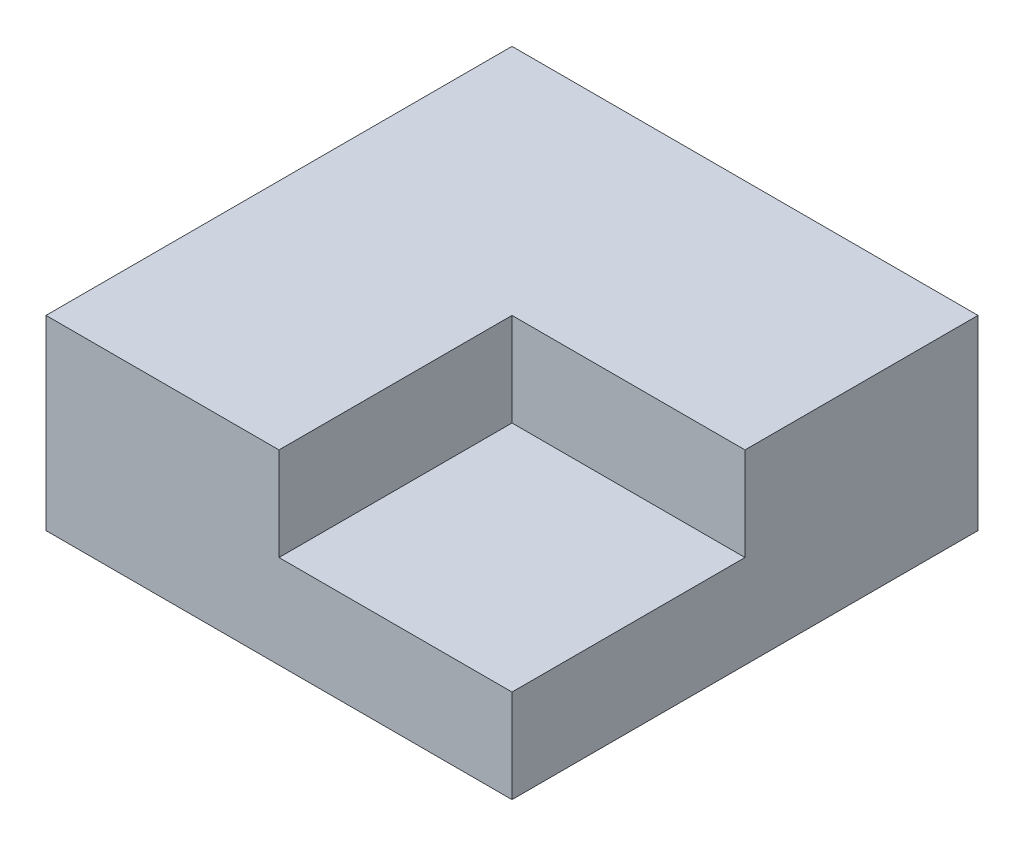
ISO-10303-21;
HEADER;
FILE_DESCRIPTION(('STEP AP214'),'2;1');
FILE_NAME('part.step','',(''),(''),'','','');
FILE_SCHEMA(('AUTOMOTIVE_DESIGN { 1 0 10303 214 1 1 1 1 }'));
ENDSEC;
DATA;
#1=APPLICATION_CONTEXT('core data for automotive mechanical design processes');
#2=APPLICATION_PROTOCOL_DEFINITION('international standard','automotive_design',2000,#1);
#3=PRODUCT_CONTEXT('',#1,'mechanical');
#4=PRODUCT('Part','Part','',(#3));
#5=PRODUCT_RELATED_PRODUCT_CATEGORY('part','',(#4));
#6=PRODUCT_DEFINITION_FORMATION('','',#4);
#7=PRODUCT_DEFINITION_CONTEXT('part definition',#1,'design');
#8=PRODUCT_DEFINITION('design','',#6,#7);
#9=PRODUCT_DEFINITION_SHAPE('','',#8);
#10=(LENGTH_UNIT() NAMED_UNIT(*) SI_UNIT(.MILLI.,.METRE.));
#11=(NAMED_UNIT(*) PLANE_ANGLE_UNIT() SI_UNIT($,.RADIAN.));
#12=(NAMED_UNIT(*) SI_UNIT($,.STERADIAN.) SOLID_ANGLE_UNIT());
#13=UNCERTAINTY_MEASURE_WITH_UNIT(LENGTH_MEASURE(1.E-05),#10,'distance_accuracy_value','');
#14=(GEOMETRIC_REPRESENTATION_CONTEXT(3) GLOBAL_UNCERTAINTY_ASSIGNED_CONTEXT((#13)) GLOBAL_UNIT_ASSIGNED_CONTEXT((#10,
#11,#12)) REPRESENTATION_CONTEXT('',''));
#15=CARTESIAN_POINT('',(0.,0.,0.));
#16=DIRECTION('',(0.,0.,1.));
#17=DIRECTION('',(1.,0.,0.));
#18=AXIS2_PLACEMENT_3D('',#15,#16,#17);
#19=CARTESIAN_POINT('',(0.,20.,0.));
#20=DIRECTION('',(1.,0.,0.));
#21=DIRECTION('',(0.,0.,-1.));
#22=AXIS2_PLACEMENT_3D('',#19,#20,#21);
#23=PLANE('',#22);
#24=DIRECTION('',(0.,0.,1.));
#25=VECTOR('',#24,1.);
#26=CARTESIAN_POINT('',(0.,0.,0.));
#27=LINE('',#26,#25);
#28=CARTESIAN_POINT('',(0.,0.,-50.));
#29=VERTEX_POINT('',#28);
#30=CARTESIAN_POINT('',(0.,0.,0.));
#31=VERTEX_POINT('',#30);
#32=EDGE_CURVE('E139',#29,#31,#27,.T.);
#33=ORIENTED_EDGE('',*,*,#32,.T.);
#34=DIRECTION('',(0.,-1.,0.));
#35=VECTOR('',#34,1.);
#36=CARTESIAN_POINT('',(0.,20.,0.));
#37=LINE('',#36,#35);
#38=CARTESIAN_POINT('',(0.,20.,0.));
#39=VERTEX_POINT('',#38);
#40=EDGE_CURVE('E11',#39,#31,#37,.T.);
#41=ORIENTED_EDGE('',*,*,#40,.F.);
#42=DIRECTION('',(0.,0.,1.));
#43=VECTOR('',#42,1.);
#44=CARTESIAN_POINT('',(0.,20.,0.));
#45=LINE('',#44,#43);
#46=CARTESIAN_POINT('',(0.,20.,-50.));
#47=VERTEX_POINT('',#46);
#48=EDGE_CURVE('E111',#47,#39,#45,.T.);
#49=ORIENTED_EDGE('',*,*,#48,.F.);
#50=DIRECTION('',(0.,-1.,0.));
#51=VECTOR('',#50,1.);
#52=CARTESIAN_POINT('',(0.,20.,-50.));
#53=LINE('',#52,#51);
#54=EDGE_CURVE('E121',#47,#29,#53,.T.);
#55=ORIENTED_EDGE('',*,*,#54,.T.);
#56=EDGE_LOOP('',(#33,#41,#49,#55));
#57=FACE_BOUND('',#56,.T.);
#58=ADVANCED_FACE('F31',(#57),#23,.F.);
#59=CARTESIAN_POINT('',(0.,20.,0.));
#60=DIRECTION('',(0.,0.,-1.));
#61=DIRECTION('',(-1.,0.,0.));
#62=AXIS2_PLACEMENT_3D('',#59,#60,#61);
#63=PLANE('',#62);
#64=DIRECTION('',(1.,0.,0.));
#65=VECTOR('',#64,1.);
#66=CARTESIAN_POINT('',(25.,10.,0.));
#67=LINE('',#66,#65);
#68=CARTESIAN_POINT('',(25.,10.,0.));
#69=VERTEX_POINT('',#68);
#70=CARTESIAN_POINT('',(50.,10.,0.));
#71=VERTEX_POINT('',#70);
#72=EDGE_CURVE('E106',#69,#71,#67,.T.);
#73=ORIENTED_EDGE('',*,*,#72,.F.);
#74=DIRECTION('',(0.,1.,0.));
#75=VECTOR('',#74,1.);
#76=CARTESIAN_POINT('',(25.,10.,0.));
#77=LINE('',#76,#75);
#78=CARTESIAN_POINT('',(25.,20.,0.));
#79=VERTEX_POINT('',#78);
#80=EDGE_CURVE('E95',#69,#79,#77,.T.);
#81=ORIENTED_EDGE('',*,*,#80,.T.);
#82=DIRECTION('',(1.,0.,0.));
#83=VECTOR('',#82,1.);
#84=CARTESIAN_POINT('',(0.,20.,0.));
#85=LINE('',#84,#83);
#86=EDGE_CURVE('E104',#39,#79,#85,.T.);
#87=ORIENTED_EDGE('',*,*,#86,.F.);
#88=ORIENTED_EDGE('',*,*,#40,.T.);
#89=DIRECTION('',(1.,0.,0.));
#90=VECTOR('',#89,1.);
#91=CARTESIAN_POINT('',(0.,0.,0.));
#92=LINE('',#91,#90);
#93=CARTESIAN_POINT('',(50.,0.,0.));
#94=VERTEX_POINT('',#93);
#95=EDGE_CURVE('E135',#31,#94,#92,.T.);
#96=ORIENTED_EDGE('',*,*,#95,.T.);
#97=DIRECTION('',(0.,-1.,0.));
#98=VECTOR('',#97,1.);
#99=CARTESIAN_POINT('',(50.,20.,0.));
#100=LINE('',#99,#98);
#101=EDGE_CURVE('E38',#71,#94,#100,.T.);
#102=ORIENTED_EDGE('',*,*,#101,.F.);
#103=EDGE_LOOP('',(#73,#81,#87,#88,#96,#102));
#104=FACE_BOUND('',#103,.T.);
#105=ADVANCED_FACE('F103',(#104),#63,.F.);
#106=CARTESIAN_POINT('',(50.,20.,0.));
#107=DIRECTION('',(-1.,0.,0.));
#108=DIRECTION('',(0.,0.,1.));
#109=AXIS2_PLACEMENT_3D('',#106,#107,#108);
#110=PLANE('',#109);
#111=DIRECTION('',(0.,0.,-1.));
#112=VECTOR('',#111,1.);
#113=CARTESIAN_POINT('',(50.,20.,0.));
#114=LINE('',#113,#112);
#115=CARTESIAN_POINT('',(50.,20.,-25.));
#116=VERTEX_POINT('',#115);
#117=CARTESIAN_POINT('',(50.,20.,-50.));
#118=VERTEX_POINT('',#117);
#119=EDGE_CURVE('E113',#116,#118,#114,.T.);
#120=ORIENTED_EDGE('',*,*,#119,.F.);
#121=DIRECTION('',(0.,1.,0.));
#122=VECTOR('',#121,1.);
#123=CARTESIAN_POINT('',(50.,10.,-25.));
#124=LINE('',#123,#122);
#125=CARTESIAN_POINT('',(50.,10.,-25.));
#126=VERTEX_POINT('',#125);
#127=EDGE_CURVE('E45',#126,#116,#124,.T.);
#128=ORIENTED_EDGE('',*,*,#127,.F.);
#129=DIRECTION('',(0.,0.,-1.));
#130=VECTOR('',#129,1.);
#131=CARTESIAN_POINT('',(50.,10.,0.));
#132=LINE('',#131,#130);
#133=EDGE_CURVE('E134',#71,#126,#132,.T.);
#134=ORIENTED_EDGE('',*,*,#133,.F.);
#135=ORIENTED_EDGE('',*,*,#101,.T.);
#136=DIRECTION('',(0.,0.,-1.));
#137=VECTOR('',#136,1.);
#138=CARTESIAN_POINT('',(50.,0.,0.));
#139=LINE('',#138,#137);
#140=CARTESIAN_POINT('',(50.,0.,-50.));
#141=VERTEX_POINT('',#140);
#142=EDGE_CURVE('E133',#94,#141,#139,.T.);
#143=ORIENTED_EDGE('',*,*,#142,.T.);
#144=DIRECTION('',(0.,-1.,0.));
#145=VECTOR('',#144,1.);
#146=CARTESIAN_POINT('',(50.,20.,-50.));
#147=LINE('',#146,#145);
#148=EDGE_CURVE('E124',#118,#141,#147,.T.);
#149=ORIENTED_EDGE('',*,*,#148,.F.);
#150=EDGE_LOOP('',(#120,#128,#134,#135,#143,#149));
#151=FACE_BOUND('',#150,.T.);
#152=ADVANCED_FACE('F130',(#151),#110,.F.);
#153=CARTESIAN_POINT('',(0.,20.,-50.));
#154=DIRECTION('',(0.,0.,1.));
#155=DIRECTION('',(1.,0.,0.));
#156=AXIS2_PLACEMENT_3D('',#153,#154,#155);
#157=PLANE('',#156);
#158=DIRECTION('',(-1.,0.,0.));
#159=VECTOR('',#158,1.);
#160=CARTESIAN_POINT('',(0.,0.,-50.));
#161=LINE('',#160,#159);
#162=EDGE_CURVE('E116',#141,#29,#161,.T.);
#163=ORIENTED_EDGE('',*,*,#162,.T.);
#164=ORIENTED_EDGE('',*,*,#54,.F.);
#165=DIRECTION('',(-1.,0.,0.));
#166=VECTOR('',#165,1.);
#167=CARTESIAN_POINT('',(0.,20.,-50.));
#168=LINE('',#167,#166);
#169=EDGE_CURVE('E53',#118,#47,#168,.T.);
#170=ORIENTED_EDGE('',*,*,#169,.F.);
#171=ORIENTED_EDGE('',*,*,#148,.T.);
#172=EDGE_LOOP('',(#163,#164,#170,#171));
#173=FACE_BOUND('',#172,.T.);
#174=ADVANCED_FACE('F156',(#173),#157,.F.);
#175=CARTESIAN_POINT('',(0.,20.,-50.));
#176=DIRECTION('',(0.,-1.,0.));
#177=DIRECTION('',(0.,0.,-1.));
#178=AXIS2_PLACEMENT_3D('',#175,#176,#177);
#179=PLANE('',#178);
#180=ORIENTED_EDGE('',*,*,#86,.T.);
#181=DIRECTION('',(0.,0.,1.));
#182=VECTOR('',#181,1.);
#183=CARTESIAN_POINT('',(25.,20.,0.));
#184=LINE('',#183,#182);
#185=CARTESIAN_POINT('',(25.,20.,-25.));
#186=VERTEX_POINT('',#185);
#187=EDGE_CURVE('E91',#186,#79,#184,.T.);
#188=ORIENTED_EDGE('',*,*,#187,.F.);
#189=DIRECTION('',(-1.,0.,0.));
#190=VECTOR('',#189,1.);
#191=CARTESIAN_POINT('',(25.,20.,-25.));
#192=LINE('',#191,#190);
#193=EDGE_CURVE('E99',#116,#186,#192,.T.);
#194=ORIENTED_EDGE('',*,*,#193,.F.);
#195=ORIENTED_EDGE('',*,*,#119,.T.);
#196=ORIENTED_EDGE('',*,*,#169,.T.);
#197=ORIENTED_EDGE('',*,*,#48,.T.);
#198=EDGE_LOOP('',(#180,#188,#194,#195,#196,#197));
#199=FACE_BOUND('',#198,.T.);
#200=ADVANCED_FACE('F109',(#199),#179,.F.);
#201=CARTESIAN_POINT('',(0.,0.,-50.));
#202=DIRECTION('',(0.,-1.,0.));
#203=DIRECTION('',(0.,0.,-1.));
#204=AXIS2_PLACEMENT_3D('',#201,#202,#203);
#205=PLANE('',#204);
#206=ORIENTED_EDGE('',*,*,#32,.F.);
#207=ORIENTED_EDGE('',*,*,#162,.F.);
#208=ORIENTED_EDGE('',*,*,#142,.F.);
#209=ORIENTED_EDGE('',*,*,#95,.F.);
#210=EDGE_LOOP('',(#206,#207,#208,#209));
#211=FACE_BOUND('',#210,.T.);
#212=ADVANCED_FACE('F142',(#211),#205,.T.);
#213=CARTESIAN_POINT('',(25.,10.,0.));
#214=DIRECTION('',(-1.,0.,0.));
#215=DIRECTION('',(0.,0.,1.));
#216=AXIS2_PLACEMENT_3D('',#213,#214,#215);
#217=PLANE('',#216);
#218=ORIENTED_EDGE('',*,*,#187,.T.);
#219=ORIENTED_EDGE('',*,*,#80,.F.);
#220=DIRECTION('',(0.,0.,1.));
#221=VECTOR('',#220,1.);
#222=CARTESIAN_POINT('',(25.,10.,0.));
#223=LINE('',#222,#221);
#224=CARTESIAN_POINT('',(25.,10.,-25.));
#225=VERTEX_POINT('',#224);
#226=EDGE_CURVE('E152',#225,#69,#223,.T.);
#227=ORIENTED_EDGE('',*,*,#226,.F.);
#228=DIRECTION('',(0.,1.,0.));
#229=VECTOR('',#228,1.);
#230=CARTESIAN_POINT('',(25.,10.,-25.));
#231=LINE('',#230,#229);
#232=EDGE_CURVE('E97',#225,#186,#231,.T.);
#233=ORIENTED_EDGE('',*,*,#232,.T.);
#234=EDGE_LOOP('',(#218,#219,#227,#233));
#235=FACE_BOUND('',#234,.T.);
#236=ADVANCED_FACE('F93',(#235),#217,.F.);
#237=CARTESIAN_POINT('',(25.,10.,-25.));
#238=DIRECTION('',(0.,0.,-1.));
#239=DIRECTION('',(-1.,0.,0.));
#240=AXIS2_PLACEMENT_3D('',#237,#238,#239);
#241=PLANE('',#240);
#242=ORIENTED_EDGE('',*,*,#193,.T.);
#243=ORIENTED_EDGE('',*,*,#232,.F.);
#244=DIRECTION('',(-1.,0.,0.));
#245=VECTOR('',#244,1.);
#246=CARTESIAN_POINT('',(25.,10.,-25.));
#247=LINE('',#246,#245);
#248=EDGE_CURVE('E107',#126,#225,#247,.T.);
#249=ORIENTED_EDGE('',*,*,#248,.F.);
#250=ORIENTED_EDGE('',*,*,#127,.T.);
#251=EDGE_LOOP('',(#242,#243,#249,#250));
#252=FACE_BOUND('',#251,.T.);
#253=ADVANCED_FACE('F154',(#252),#241,.F.);
#254=CARTESIAN_POINT('',(25.,10.,0.));
#255=DIRECTION('',(0.,-1.,0.));
#256=DIRECTION('',(0.,0.,-1.));
#257=AXIS2_PLACEMENT_3D('',#254,#255,#256);
#258=PLANE('',#257);
#259=ORIENTED_EDGE('',*,*,#226,.T.);
#260=ORIENTED_EDGE('',*,*,#72,.T.);
#261=ORIENTED_EDGE('',*,*,#133,.T.);
#262=ORIENTED_EDGE('',*,*,#248,.T.);
#263=EDGE_LOOP('',(#259,#260,#261,#262));
#264=FACE_BOUND('',#263,.T.);
#265=ADVANCED_FACE('F177',(#264),#258,.F.);
#266=CLOSED_SHELL('',(#58,#105,#152,#174,#200,#212,#236,#253,#265));
#267=MANIFOLD_SOLID_BREP('B2',#266);
#268=ADVANCED_BREP_SHAPE_REPRESENTATION('',(#18,#267),#14);
#269=SHAPE_DEFINITION_REPRESENTATION(#9,#268);
ENDSEC;
END-ISO-10303-21;
